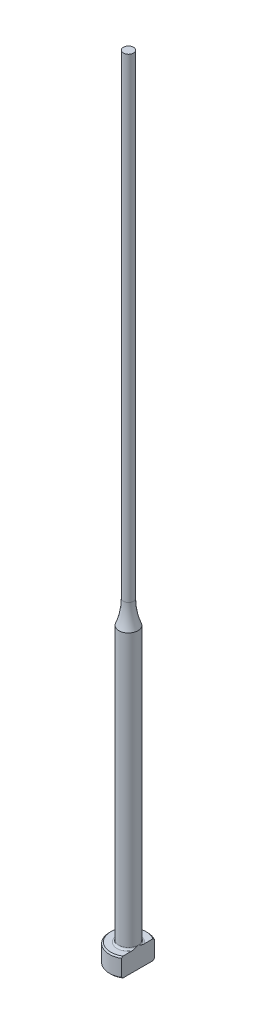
ISO-10303-21;
HEADER;
FILE_DESCRIPTION(('STEP AP214'),'2;1');
FILE_NAME('part.step','',(''),(''),'','','');
FILE_SCHEMA(('AUTOMOTIVE_DESIGN { 1 0 10303 214 1 1 1 1 }'));
ENDSEC;
DATA;
#1=APPLICATION_CONTEXT('core data for automotive mechanical design processes');
#2=APPLICATION_PROTOCOL_DEFINITION('international standard','automotive_design',2000,#1);
#3=PRODUCT_CONTEXT('',#1,'mechanical');
#4=PRODUCT('Part','Part','',(#3));
#5=PRODUCT_RELATED_PRODUCT_CATEGORY('part','',(#4));
#6=PRODUCT_DEFINITION_FORMATION('','',#4);
#7=PRODUCT_DEFINITION_CONTEXT('part definition',#1,'design');
#8=PRODUCT_DEFINITION('design','',#6,#7);
#9=PRODUCT_DEFINITION_SHAPE('','',#8);
#10=(LENGTH_UNIT() NAMED_UNIT(*) SI_UNIT(.MILLI.,.METRE.));
#11=(NAMED_UNIT(*) PLANE_ANGLE_UNIT() SI_UNIT($,.RADIAN.));
#12=(NAMED_UNIT(*) SI_UNIT($,.STERADIAN.) SOLID_ANGLE_UNIT());
#13=UNCERTAINTY_MEASURE_WITH_UNIT(LENGTH_MEASURE(1.E-05),#10,'distance_accuracy_value','');
#14=(GEOMETRIC_REPRESENTATION_CONTEXT(3) GLOBAL_UNCERTAINTY_ASSIGNED_CONTEXT((#13)) GLOBAL_UNIT_ASSIGNED_CONTEXT((#10,
#11,#12)) REPRESENTATION_CONTEXT('',''));
#15=CARTESIAN_POINT('',(0.,0.,0.));
#16=DIRECTION('',(0.,0.,1.));
#17=DIRECTION('',(1.,0.,0.));
#18=AXIS2_PLACEMENT_3D('',#15,#16,#17);
#19=CARTESIAN_POINT('',(-2.99999999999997,3.,0.));
#20=DIRECTION('',(0.,1.,0.));
#21=DIRECTION('',(0.,0.,1.));
#22=AXIS2_PLACEMENT_3D('',#19,#20,#21);
#23=PLANE('',#22);
#24=CARTESIAN_POINT('',(0.,3.,0.));
#25=DIRECTION('',(0.,1.,0.));
#26=DIRECTION('',(0.,0.,1.));
#27=AXIS2_PLACEMENT_3D('',#24,#25,#26);
#28=CIRCLE('',#27,2.79999999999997);
#29=CARTESIAN_POINT('',(1.49999999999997,3.,-2.36431808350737));
#30=VERTEX_POINT('',#29);
#31=CARTESIAN_POINT('',(1.49999999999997,3.,2.36431808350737));
#32=VERTEX_POINT('',#31);
#33=EDGE_CURVE('E187',#30,#32,#28,.T.);
#34=ORIENTED_EDGE('',*,*,#33,.T.);
#35=DIRECTION('',(0.,0.,-1.));
#36=VECTOR('',#35,1.);
#37=CARTESIAN_POINT('',(1.49999999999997,3.,0.));
#38=LINE('',#37,#36);
#39=CARTESIAN_POINT('',(1.49999999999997,3.00000000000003,0.99498743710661));
#40=VERTEX_POINT('',#39);
#41=EDGE_CURVE('E57',#32,#40,#38,.T.);
#42=ORIENTED_EDGE('',*,*,#41,.T.);
#43=CARTESIAN_POINT('',(0.,3.,0.));
#44=DIRECTION('',(0.,1.,0.));
#45=DIRECTION('',(0.,0.,1.));
#46=AXIS2_PLACEMENT_3D('',#43,#44,#45);
#47=CIRCLE('',#46,1.79999999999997);
#48=CARTESIAN_POINT('',(1.49999999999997,3.00000000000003,-0.994987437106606));
#49=VERTEX_POINT('',#48);
#50=EDGE_CURVE('E108',#40,#49,#47,.F.);
#51=ORIENTED_EDGE('',*,*,#50,.T.);
#52=EDGE_CURVE('E137',#49,#30,#38,.T.);
#53=ORIENTED_EDGE('',*,*,#52,.T.);
#54=EDGE_LOOP('',(#34,#42,#51,#53));
#55=FACE_BOUND('',#54,.T.);
#56=ADVANCED_FACE('F32',(#55),#23,.T.);
#57=CARTESIAN_POINT('',(0.,259.958771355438,0.));
#58=DIRECTION('',(0.,1.,0.));
#59=DIRECTION('',(0.,0.,1.));
#60=AXIS2_PLACEMENT_3D('',#57,#58,#59);
#61=CYLINDRICAL_SURFACE('',#60,2.99999999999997);
#62=CARTESIAN_POINT('',(0.,2.80000000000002,0.));
#63=DIRECTION('',(0.,1.,0.));
#64=DIRECTION('',(0.,0.,1.));
#65=AXIS2_PLACEMENT_3D('',#62,#63,#64);
#66=CIRCLE('',#65,2.99999999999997);
#67=CARTESIAN_POINT('',(1.49999999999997,2.80000000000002,2.5980762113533));
#68=VERTEX_POINT('',#67);
#69=CARTESIAN_POINT('',(1.49999999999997,2.80000000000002,-2.5980762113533));
#70=VERTEX_POINT('',#69);
#71=EDGE_CURVE('E105',#68,#70,#66,.F.);
#72=ORIENTED_EDGE('',*,*,#71,.T.);
#73=DIRECTION('',(0.,-1.,0.));
#74=VECTOR('',#73,1.);
#75=CARTESIAN_POINT('',(1.49999999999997,125.,-2.5980762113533));
#76=LINE('',#75,#74);
#77=CARTESIAN_POINT('',(1.49999999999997,0.200000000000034,-2.5980762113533));
#78=VERTEX_POINT('',#77);
#79=EDGE_CURVE('E193',#70,#78,#76,.T.);
#80=ORIENTED_EDGE('',*,*,#79,.T.);
#81=CARTESIAN_POINT('',(0.,0.200000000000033,0.));
#82=DIRECTION('',(0.,-1.,0.));
#83=DIRECTION('',(0.,0.,-1.));
#84=AXIS2_PLACEMENT_3D('',#81,#82,#83);
#85=CIRCLE('',#84,2.99999999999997);
#86=CARTESIAN_POINT('',(1.49999999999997,0.200000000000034,2.5980762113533));
#87=VERTEX_POINT('',#86);
#88=EDGE_CURVE('E100',#78,#87,#85,.F.);
#89=ORIENTED_EDGE('',*,*,#88,.T.);
#90=DIRECTION('',(0.,-1.,0.));
#91=VECTOR('',#90,1.);
#92=CARTESIAN_POINT('',(1.49999999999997,125.,2.5980762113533));
#93=LINE('',#92,#91);
#94=EDGE_CURVE('E93',#68,#87,#93,.T.);
#95=ORIENTED_EDGE('',*,*,#94,.F.);
#96=EDGE_LOOP('',(#72,#80,#89,#95));
#97=FACE_BOUND('',#96,.T.);
#98=ADVANCED_FACE('F158',(#97),#61,.T.);
#99=CARTESIAN_POINT('',(0.,0.,0.));
#100=DIRECTION('',(0.,-1.,0.));
#101=DIRECTION('',(0.,0.,-1.));
#102=AXIS2_PLACEMENT_3D('',#99,#100,#101);
#103=PLANE('',#102);
#104=CARTESIAN_POINT('',(0.,0.,0.));
#105=DIRECTION('',(0.,-1.,0.));
#106=DIRECTION('',(0.,0.,-1.));
#107=AXIS2_PLACEMENT_3D('',#104,#105,#106);
#108=CIRCLE('',#107,2.79999999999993);
#109=CARTESIAN_POINT('',(1.49999999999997,0.,2.36431808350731));
#110=VERTEX_POINT('',#109);
#111=CARTESIAN_POINT('',(1.49999999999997,0.,-2.36431808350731));
#112=VERTEX_POINT('',#111);
#113=EDGE_CURVE('E98',#110,#112,#108,.T.);
#114=ORIENTED_EDGE('',*,*,#113,.T.);
#115=DIRECTION('',(0.,0.,1.));
#116=VECTOR('',#115,1.);
#117=CARTESIAN_POINT('',(1.49999999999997,0.,-2.5980762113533));
#118=LINE('',#117,#116);
#119=EDGE_CURVE('E83',#112,#110,#118,.T.);
#120=ORIENTED_EDGE('',*,*,#119,.T.);
#121=EDGE_LOOP('',(#114,#120));
#122=FACE_BOUND('',#121,.T.);
#123=ADVANCED_FACE('F103',(#122),#103,.T.);
#124=CARTESIAN_POINT('',(0.,3.,0.));
#125=DIRECTION('',(0.,-1.,0.));
#126=DIRECTION('',(0.,0.,-1.));
#127=AXIS2_PLACEMENT_3D('',#124,#125,#126);
#128=CONICAL_SURFACE('',#127,2.79999999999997,0.7853981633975);
#129=ORIENTED_EDGE('',*,*,#71,.F.);
#130=CARTESIAN_POINT('',(1.49999999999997,-0.11174109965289,5.71827621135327));
#131=CARTESIAN_POINT('',(1.49999999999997,0.0136183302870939,5.58866816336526));
#132=CARTESIAN_POINT('',(1.49999999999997,0.138843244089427,5.45892957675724));
#133=CARTESIAN_POINT('',(1.49999999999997,0.388944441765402,5.19911365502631));
#134=CARTESIAN_POINT('',(1.49999999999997,0.513820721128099,5.06903631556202));
#135=CARTESIAN_POINT('',(1.49999999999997,0.763205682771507,4.8084018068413));
#136=CARTESIAN_POINT('',(1.49999999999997,0.887714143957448,4.67784442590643));
#137=CARTESIAN_POINT('',(1.49999999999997,1.13618059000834,4.41620813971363));
#138=CARTESIAN_POINT('',(1.49999999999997,1.2601385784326,4.28512923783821));
#139=CARTESIAN_POINT('',(1.49999999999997,1.50488975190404,4.02490837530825));
#140=CARTESIAN_POINT('',(1.49999999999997,1.6256969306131,3.89577958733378));
#141=CARTESIAN_POINT('',(1.49999999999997,1.86640694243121,3.63668213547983));
#142=CARTESIAN_POINT('',(1.49999999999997,1.98630978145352,3.5067134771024));
#143=CARTESIAN_POINT('',(1.49999999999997,2.22486033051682,3.24567921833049));
#144=CARTESIAN_POINT('',(1.49999999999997,2.34350830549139,3.11461386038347));
#145=CARTESIAN_POINT('',(1.49999999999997,2.57907716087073,2.85094268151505));
#146=CARTESIAN_POINT('',(1.49999999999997,2.69599811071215,2.71833692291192));
#147=CARTESIAN_POINT('',(1.49999999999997,2.88262371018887,2.50255231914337));
#148=CARTESIAN_POINT('',(1.49999999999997,2.95312454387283,2.42006293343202));
#149=CARTESIAN_POINT('',(1.49999999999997,3.09287098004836,2.25401084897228));
#150=CARTESIAN_POINT('',(1.49999999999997,3.16211645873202,2.170448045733));
#151=CARTESIAN_POINT('',(1.49999999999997,3.2996468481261,2.00105967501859));
#152=CARTESIAN_POINT('',(1.49999999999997,3.36791386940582,1.91521952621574));
#153=CARTESIAN_POINT('',(1.49999999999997,3.50205840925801,1.74171392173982));
#154=CARTESIAN_POINT('',(1.49999999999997,3.56793649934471,1.65404891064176));
#155=CARTESIAN_POINT('',(1.49999999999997,3.69728151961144,1.47490236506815));
#156=CARTESIAN_POINT('',(1.49999999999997,3.76069661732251,1.38338308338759));
#157=CARTESIAN_POINT('',(1.49999999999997,3.88239539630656,1.1967566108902));
#158=CARTESIAN_POINT('',(1.49999999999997,3.94067201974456,1.10164473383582));
#159=CARTESIAN_POINT('',(1.49999999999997,4.0484132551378,0.908008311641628));
#160=CARTESIAN_POINT('',(1.49999999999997,4.09797809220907,0.809540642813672));
#161=CARTESIAN_POINT('',(1.49999999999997,4.18432188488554,0.607192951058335));
#162=CARTESIAN_POINT('',(1.49999999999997,4.22114374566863,0.503332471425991));
#163=CARTESIAN_POINT('',(1.49999999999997,4.26099935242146,0.347577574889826));
#164=CARTESIAN_POINT('',(1.49999999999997,4.27157029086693,0.29760995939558));
#165=CARTESIAN_POINT('',(1.49999999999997,4.28794860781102,0.196885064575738));
#166=CARTESIAN_POINT('',(1.49999999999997,4.29375640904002,0.146127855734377));
#167=CARTESIAN_POINT('',(1.49999999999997,4.30019707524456,0.0444388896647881));
#168=CARTESIAN_POINT('',(1.49999999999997,4.30084594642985,-0.00649183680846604));
#169=CARTESIAN_POINT('',(1.49999999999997,4.29696416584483,-0.108155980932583));
#170=CARTESIAN_POINT('',(1.49999999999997,4.29243308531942,-0.158889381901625));
#171=CARTESIAN_POINT('',(1.49999999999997,4.27856915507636,-0.259234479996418));
#172=CARTESIAN_POINT('',(1.49999999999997,4.26927821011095,-0.308852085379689));
#173=CARTESIAN_POINT('',(1.49999999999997,4.24647108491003,-0.407110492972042));
#174=CARTESIAN_POINT('',(1.49999999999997,4.2329532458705,-0.455750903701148));
#175=CARTESIAN_POINT('',(1.49999999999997,4.20226175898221,-0.552149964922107));
#176=CARTESIAN_POINT('',(1.49999999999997,4.18506801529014,-0.599902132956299));
#177=CARTESIAN_POINT('',(1.49999999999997,4.14771387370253,-0.694205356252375));
#178=CARTESIAN_POINT('',(1.49999999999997,4.12755408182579,-0.740756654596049));
#179=CARTESIAN_POINT('',(1.49999999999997,4.06327696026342,-0.879166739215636));
#180=CARTESIAN_POINT('',(1.49999999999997,4.01551721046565,-0.969329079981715));
#181=CARTESIAN_POINT('',(1.49999999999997,3.91367909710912,-1.1460431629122));
#182=CARTESIAN_POINT('',(1.49999999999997,3.85959300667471,-1.23259031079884));
#183=CARTESIAN_POINT('',(1.49999999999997,3.74697968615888,-1.40321348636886));
#184=CARTESIAN_POINT('',(1.49999999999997,3.68843573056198,-1.48727838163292));
#185=CARTESIAN_POINT('',(1.49999999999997,3.56843845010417,-1.65322187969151));
#186=CARTESIAN_POINT('',(1.49999999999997,3.50698656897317,-1.73510153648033));
#187=CARTESIAN_POINT('',(1.49999999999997,3.38115673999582,-1.89829823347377));
#188=CARTESIAN_POINT('',(1.49999999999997,3.31675092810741,-1.9795936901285));
#189=CARTESIAN_POINT('',(1.49999999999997,3.18634068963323,-2.14090082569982));
#190=CARTESIAN_POINT('',(1.49999999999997,3.12033609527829,-2.22091236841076));
#191=CARTESIAN_POINT('',(1.49999999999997,2.9208643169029,-2.4590650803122));
#192=CARTESIAN_POINT('',(1.49999999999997,2.78562663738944,-2.6157209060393));
#193=CARTESIAN_POINT('',(1.49999999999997,2.53554498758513,-2.90006295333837));
#194=CARTESIAN_POINT('',(1.49999999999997,2.421145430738,-3.02814382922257));
#195=CARTESIAN_POINT('',(1.49999999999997,2.19093557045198,-3.28303767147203));
#196=CARTESIAN_POINT('',(1.49999999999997,2.07512522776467,-3.40985060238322));
#197=CARTESIAN_POINT('',(1.49999999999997,1.72597067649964,-3.78913849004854));
#198=CARTESIAN_POINT('',(1.49999999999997,1.49111760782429,-4.04022177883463));
#199=CARTESIAN_POINT('',(1.49999999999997,1.02882478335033,-4.52992803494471));
#200=CARTESIAN_POINT('',(1.49999999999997,0.801477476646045,-4.76863870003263));
#201=CARTESIAN_POINT('',(1.49999999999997,0.459548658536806,-5.12558036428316));
#202=CARTESIAN_POINT('',(1.49999999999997,0.345484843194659,-5.24430773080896));
#203=CARTESIAN_POINT('',(1.49999999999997,0.117071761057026,-5.48148573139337));
#204=CARTESIAN_POINT('',(1.49999999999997,0.00272249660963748,-5.59993636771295));
#205=CARTESIAN_POINT('',(1.49999999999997,-0.111741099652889,-5.71827621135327));
#206=B_SPLINE_CURVE_WITH_KNOTS('',3,(#130,#131,#132,#133,#134,#135,#136,#137,#138,#139,#140,
#141,#142,#143,#144,#145,#146,#147,#148,#149,#150,#151,#152,#153,#154,#155,#156,#157,#158,#159,
#160,#161,#162,#163,#164,#165,#166,#167,#168,#169,#170,#171,#172,#173,#174,#175,#176,#177,#178,
#179,#180,#181,#182,#183,#184,#185,#186,#187,#188,#189,#190,#191,#192,#193,#194,#195,#196,#197,
#198,#199,#200,#201,#202,#203,#204,#205),.UNSPECIFIED.,.F.,.F.,(4,2,2,2,2,2,2,2,2,2,2,2,2,2,2,2,
2,2,2,2,2,2,2,2,2,2,2,2,2,2,2,2,2,2,2,2,2,4),(0.,0.540943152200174,1.08189327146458,
1.62312052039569,2.16434426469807,2.69482920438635,3.22531067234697,3.75567781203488,
4.28602356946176,4.61155053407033,4.93710943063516,5.26610945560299,5.59503024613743,
5.92894782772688,6.26331713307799,6.59354403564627,6.92264800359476,7.07567478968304,
7.22868799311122,7.38122626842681,7.53377717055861,7.68500755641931,7.83629736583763,
7.98843643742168,8.14054446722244,8.4461879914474,8.75220879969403,9.05944044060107,
9.366521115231,9.677642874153,9.98879742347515,10.6095925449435,11.1247803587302,
11.6399825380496,12.6713544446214,13.6603005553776,14.1542238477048,14.648143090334),.UNSPECIFIED.);
#207=EDGE_CURVE('E136',#68,#32,#206,.T.);
#208=ORIENTED_EDGE('',*,*,#207,.T.);
#209=ORIENTED_EDGE('',*,*,#33,.F.);
#210=EDGE_CURVE('E128',#30,#70,#206,.T.);
#211=ORIENTED_EDGE('',*,*,#210,.T.);
#212=EDGE_LOOP('',(#129,#208,#209,#211));
#213=FACE_BOUND('',#212,.T.);
#214=ADVANCED_FACE('F144',(#213),#128,.T.);
#215=CARTESIAN_POINT('',(0.,0.200000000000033,0.));
#216=DIRECTION('',(0.,1.,0.));
#217=DIRECTION('',(0.,0.,1.));
#218=AXIS2_PLACEMENT_3D('',#215,#216,#217);
#219=CONICAL_SURFACE('',#218,2.99999999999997,0.785398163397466);
#220=ORIENTED_EDGE('',*,*,#88,.F.);
#221=CARTESIAN_POINT('',(1.49999999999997,3.11174109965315,-5.71827621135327));
#222=CARTESIAN_POINT('',(1.49999999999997,2.98638166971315,-5.58866816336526));
#223=CARTESIAN_POINT('',(1.49999999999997,2.8611567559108,-5.45892957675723));
#224=CARTESIAN_POINT('',(1.49999999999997,2.6110555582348,-5.19911365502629));
#225=CARTESIAN_POINT('',(1.49999999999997,2.48617927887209,-5.06903631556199));
#226=CARTESIAN_POINT('',(1.49999999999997,2.23679431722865,-4.80840180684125));
#227=CARTESIAN_POINT('',(1.49999999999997,2.11228585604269,-4.67784442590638));
#228=CARTESIAN_POINT('',(1.49999999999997,1.86381940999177,-4.41620813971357));
#229=CARTESIAN_POINT('',(1.49999999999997,1.7398614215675,-4.28512923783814));
#230=CARTESIAN_POINT('',(1.49999999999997,1.49511024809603,-4.02490837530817));
#231=CARTESIAN_POINT('',(1.49999999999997,1.37430306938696,-3.89577958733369));
#232=CARTESIAN_POINT('',(1.49999999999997,1.13359305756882,-3.63668213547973));
#233=CARTESIAN_POINT('',(1.49999999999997,1.0136902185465,-3.50671347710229));
#234=CARTESIAN_POINT('',(1.49999999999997,0.775139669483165,-3.24567921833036));
#235=CARTESIAN_POINT('',(1.49999999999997,0.656491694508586,-3.11461386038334));
#236=CARTESIAN_POINT('',(1.49999999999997,0.420922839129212,-2.85094268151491));
#237=CARTESIAN_POINT('',(1.49999999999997,0.304001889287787,-2.71833692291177));
#238=CARTESIAN_POINT('',(1.49999999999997,0.117376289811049,-2.50255231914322));
#239=CARTESIAN_POINT('',(1.49999999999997,0.0468754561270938,-2.42006293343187));
#240=CARTESIAN_POINT('',(1.49999999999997,-0.0928709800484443,-2.25401084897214));
#241=CARTESIAN_POINT('',(1.49999999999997,-0.162116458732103,-2.17044804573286));
#242=CARTESIAN_POINT('',(1.49999999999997,-0.299646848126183,-2.00105967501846));
#243=CARTESIAN_POINT('',(1.49999999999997,-0.367913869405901,-1.91521952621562));
#244=CARTESIAN_POINT('',(1.49999999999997,-0.502058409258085,-1.74171392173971));
#245=CARTESIAN_POINT('',(1.49999999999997,-0.567936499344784,-1.65404891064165));
#246=CARTESIAN_POINT('',(1.49999999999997,-0.697281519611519,-1.47490236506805));
#247=CARTESIAN_POINT('',(1.49999999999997,-0.760696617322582,-1.38338308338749));
#248=CARTESIAN_POINT('',(1.49999999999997,-0.882395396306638,-1.19675661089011));
#249=CARTESIAN_POINT('',(1.49999999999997,-0.940672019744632,-1.10164473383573));
#250=CARTESIAN_POINT('',(1.49999999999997,-1.04841325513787,-0.908008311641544));
#251=CARTESIAN_POINT('',(1.49999999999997,-1.09797809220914,-0.809540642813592));
#252=CARTESIAN_POINT('',(1.49999999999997,-1.1843218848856,-0.60719295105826));
#253=CARTESIAN_POINT('',(1.49999999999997,-1.22114374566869,-0.503332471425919));
#254=CARTESIAN_POINT('',(1.49999999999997,-1.26099935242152,-0.347577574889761));
#255=CARTESIAN_POINT('',(1.49999999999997,-1.27157029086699,-0.29760995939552));
#256=CARTESIAN_POINT('',(1.49999999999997,-1.28794860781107,-0.196885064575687));
#257=CARTESIAN_POINT('',(1.49999999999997,-1.29375640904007,-0.146127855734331));
#258=CARTESIAN_POINT('',(1.49999999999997,-1.30019707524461,-0.0444388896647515));
#259=CARTESIAN_POINT('',(1.49999999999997,-1.3008459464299,0.00649183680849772));
#260=CARTESIAN_POINT('',(1.49999999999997,-1.29696416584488,0.108155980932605));
#261=CARTESIAN_POINT('',(1.49999999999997,-1.29243308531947,0.158889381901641));
#262=CARTESIAN_POINT('',(1.49999999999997,-1.2785691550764,0.259234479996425));
#263=CARTESIAN_POINT('',(1.49999999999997,-1.26927821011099,0.308852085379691));
#264=CARTESIAN_POINT('',(1.49999999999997,-1.24647108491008,0.407110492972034));
#265=CARTESIAN_POINT('',(1.49999999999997,-1.23295324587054,0.455750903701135));
#266=CARTESIAN_POINT('',(1.49999999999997,-1.20226175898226,0.552149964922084));
#267=CARTESIAN_POINT('',(1.49999999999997,-1.18506801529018,0.599902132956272));
#268=CARTESIAN_POINT('',(1.49999999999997,-1.14771387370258,0.694205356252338));
#269=CARTESIAN_POINT('',(1.49999999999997,-1.12755408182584,0.740756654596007));
#270=CARTESIAN_POINT('',(1.49999999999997,-1.06327696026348,0.879166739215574));
#271=CARTESIAN_POINT('',(1.49999999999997,-1.01551721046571,0.969329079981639));
#272=CARTESIAN_POINT('',(1.49999999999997,-0.913679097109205,1.1460431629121));
#273=CARTESIAN_POINT('',(1.49999999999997,-0.8595930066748,1.23259031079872));
#274=CARTESIAN_POINT('',(1.49999999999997,-0.746979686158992,1.40321348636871));
#275=CARTESIAN_POINT('',(1.49999999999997,-0.688435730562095,1.48727838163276));
#276=CARTESIAN_POINT('',(1.49999999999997,-0.568438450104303,1.65322187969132));
#277=CARTESIAN_POINT('',(1.49999999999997,-0.506986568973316,1.73510153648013));
#278=CARTESIAN_POINT('',(1.49999999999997,-0.381156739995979,1.89829823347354));
#279=CARTESIAN_POINT('',(1.49999999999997,-0.316750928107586,1.97959369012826));
#280=CARTESIAN_POINT('',(1.49999999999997,-0.186340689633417,2.14090082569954));
#281=CARTESIAN_POINT('',(1.49999999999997,-0.120336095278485,2.22091236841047));
#282=CARTESIAN_POINT('',(1.49999999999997,0.0791356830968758,2.45906508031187));
#283=CARTESIAN_POINT('',(1.49999999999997,0.214373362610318,2.61572090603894));
#284=CARTESIAN_POINT('',(1.49999999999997,0.46445501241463,2.90006295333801));
#285=CARTESIAN_POINT('',(1.49999999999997,0.578854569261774,3.02814382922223));
#286=CARTESIAN_POINT('',(1.49999999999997,0.809064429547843,3.28303767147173));
#287=CARTESIAN_POINT('',(1.49999999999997,0.924874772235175,3.40985060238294));
#288=CARTESIAN_POINT('',(1.49999999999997,1.27402932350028,3.78913849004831));
#289=CARTESIAN_POINT('',(1.49999999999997,1.50888239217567,4.04022177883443));
#290=CARTESIAN_POINT('',(1.49999999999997,1.97117521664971,4.52992803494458));
#291=CARTESIAN_POINT('',(1.49999999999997,2.19852252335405,4.76863870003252));
#292=CARTESIAN_POINT('',(1.49999999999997,2.54045134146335,5.12558036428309));
#293=CARTESIAN_POINT('',(1.49999999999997,2.65451515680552,5.2443077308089));
#294=CARTESIAN_POINT('',(1.49999999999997,2.88292823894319,5.48148573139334));
#295=CARTESIAN_POINT('',(1.49999999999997,2.9972775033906,5.59993636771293));
#296=CARTESIAN_POINT('',(1.49999999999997,3.11174109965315,5.71827621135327));
#297=B_SPLINE_CURVE_WITH_KNOTS('',3,(#221,#222,#223,#224,#225,#226,#227,#228,#229,#230,#231,
#232,#233,#234,#235,#236,#237,#238,#239,#240,#241,#242,#243,#244,#245,#246,#247,#248,#249,#250,
#251,#252,#253,#254,#255,#256,#257,#258,#259,#260,#261,#262,#263,#264,#265,#266,#267,#268,#269,
#270,#271,#272,#273,#274,#275,#276,#277,#278,#279,#280,#281,#282,#283,#284,#285,#286,#287,#288,
#289,#290,#291,#292,#293,#294,#295,#296),.UNSPECIFIED.,.F.,.F.,(4,2,2,2,2,2,2,2,2,2,2,2,2,2,2,2,
2,2,2,2,2,2,2,2,2,2,2,2,2,2,2,2,2,2,2,2,2,4),(0.,0.540943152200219,1.08189327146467,
1.62312052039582,2.16434426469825,2.69482920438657,3.22531067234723,3.75567781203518,
4.28602356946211,4.61155053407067,4.93710943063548,5.2661094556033,5.59503024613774,
5.92894782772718,6.26331713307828,6.59354403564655,6.92264800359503,7.0756747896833,
7.22868799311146,7.38122626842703,7.53377717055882,7.68500755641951,7.83629736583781,
7.98843643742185,8.14054446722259,8.4461879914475,8.75220879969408,9.05944044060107,
9.36652111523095,9.6776428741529,9.98879742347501,10.6095925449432,11.1247803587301,
11.6399825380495,12.6713544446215,13.6603005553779,14.1542238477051,14.6481430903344),.UNSPECIFIED.);
#298=EDGE_CURVE('E86',#78,#112,#297,.T.);
#299=ORIENTED_EDGE('',*,*,#298,.T.);
#300=ORIENTED_EDGE('',*,*,#113,.F.);
#301=EDGE_CURVE('E89',#110,#87,#297,.T.);
#302=ORIENTED_EDGE('',*,*,#301,.T.);
#303=EDGE_LOOP('',(#220,#299,#300,#302));
#304=FACE_BOUND('',#303,.T.);
#305=ADVANCED_FACE('F97',(#304),#219,.T.);
#306=CARTESIAN_POINT('',(0.,3.30000000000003,0.));
#307=DIRECTION('',(0.,1.,0.));
#308=DIRECTION('',(0.,0.,1.));
#309=AXIS2_PLACEMENT_3D('',#306,#307,#308);
#310=TOROIDAL_SURFACE('',#309,1.79999999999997,0.3);
#311=CARTESIAN_POINT('',(1.49999999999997,3.30000000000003,0.));
#312=CARTESIAN_POINT('',(1.49999999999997,3.300000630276,3.41555678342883E-12));
#313=CARTESIAN_POINT('',(1.49999999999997,3.30000126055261,-1.15373640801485E-07));
#314=CARTESIAN_POINT('',(1.49999999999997,3.3000024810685,-4.90631575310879E-07));
#315=CARTESIAN_POINT('',(1.49999999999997,3.30000307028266,-7.53296670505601E-07));
#316=CARTESIAN_POINT('',(1.49999999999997,3.30000424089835,-1.38757096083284E-06));
#317=CARTESIAN_POINT('',(1.49999999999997,3.300004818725,-1.76563001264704E-06));
#318=CARTESIAN_POINT('',(1.49999999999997,3.30000591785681,-2.58768006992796E-06));
#319=CARTESIAN_POINT('',(1.49999999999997,3.30000643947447,-3.03127014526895E-06));
#320=CARTESIAN_POINT('',(1.49999999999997,3.30000815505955,-4.60021967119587E-06));
#321=CARTESIAN_POINT('',(1.49999999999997,3.30000927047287,-5.8124152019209E-06));
#322=CARTESIAN_POINT('',(1.49999999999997,3.30001128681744,-8.33989413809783E-06));
#323=CARTESIAN_POINT('',(1.49999999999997,3.30001219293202,-9.65128157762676E-06));
#324=CARTESIAN_POINT('',(1.49999999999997,3.30001551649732,-1.46782505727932E-05));
#325=CARTESIAN_POINT('',(1.49999999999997,3.30001775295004,-1.8517976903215E-05));
#326=CARTESIAN_POINT('',(1.49999999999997,3.30002148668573,-2.61616194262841E-05));
#327=CARTESIAN_POINT('',(1.49999999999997,3.30002302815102,-2.99447742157E-05));
#328=CARTESIAN_POINT('',(1.49999999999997,3.30002943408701,-4.58003743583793E-05));
#329=CARTESIAN_POINT('',(1.49999999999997,3.3000341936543,-5.79079078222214E-05));
#330=CARTESIAN_POINT('',(1.49999999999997,3.30004197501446,-8.07263755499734E-05));
#331=CARTESIAN_POINT('',(1.49999999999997,3.30004514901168,-9.13834709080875E-05));
#332=CARTESIAN_POINT('',(1.49999999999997,3.30006989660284,-0.000167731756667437));
#333=CARTESIAN_POINT('',(1.49999999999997,3.30010092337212,-0.000229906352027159));
#334=CARTESIAN_POINT('',(1.49999999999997,3.30021632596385,-0.000470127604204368));
#335=CARTESIAN_POINT('',(1.49999999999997,3.30029368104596,-0.000650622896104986));
#336=CARTESIAN_POINT('',(1.49999999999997,3.30059619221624,-0.00134589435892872));
#337=CARTESIAN_POINT('',(1.49999999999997,3.30082870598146,-0.00185814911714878));
#338=CARTESIAN_POINT('',(1.49999999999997,3.30176696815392,-0.00393547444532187));
#339=CARTESIAN_POINT('',(1.49999999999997,3.30246445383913,-0.00550332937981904));
#340=CARTESIAN_POINT('',(1.49999999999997,3.31426785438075,-0.0320229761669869));
#341=CARTESIAN_POINT('',(1.49999999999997,3.32544800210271,-0.0569503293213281));
#342=CARTESIAN_POINT('',(1.49999999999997,3.34725700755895,-0.105984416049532));
#343=CARTESIAN_POINT('',(1.49999999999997,3.35789134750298,-0.130088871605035));
#344=CARTESIAN_POINT('',(1.49999999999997,3.38015321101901,-0.181096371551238));
#345=CARTESIAN_POINT('',(1.49999999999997,3.39175804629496,-0.208009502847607));
#346=CARTESIAN_POINT('',(1.49999999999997,3.41469034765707,-0.262264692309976));
#347=CARTESIAN_POINT('',(1.49999999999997,3.42601398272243,-0.289608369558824));
#348=CARTESIAN_POINT('',(1.49999999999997,3.45363212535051,-0.35820378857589));
#349=CARTESIAN_POINT('',(1.49999999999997,3.46959026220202,-0.39959288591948));
#350=CARTESIAN_POINT('',(1.49999999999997,3.49940505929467,-0.482097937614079));
#351=CARTESIAN_POINT('',(1.49999999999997,3.51330033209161,-0.523199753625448));
#352=CARTESIAN_POINT('',(1.49999999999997,3.53552507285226,-0.595497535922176));
#353=CARTESIAN_POINT('',(1.49999999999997,3.54436834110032,-0.626532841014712));
#354=CARTESIAN_POINT('',(1.49999999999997,3.56052427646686,-0.6891760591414));
#355=CARTESIAN_POINT('',(1.49999999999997,3.5678279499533,-0.720786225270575));
#356=CARTESIAN_POINT('',(1.49999999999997,3.5875075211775,-0.819524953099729));
#357=CARTESIAN_POINT('',(1.49999999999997,3.59661044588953,-0.88742909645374));
#358=CARTESIAN_POINT('',(1.49999999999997,3.60059842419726,-0.991180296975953));
#359=CARTESIAN_POINT('',(1.49999999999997,3.60019840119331,-1.02684364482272));
#360=CARTESIAN_POINT('',(1.49999999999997,3.59497085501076,-1.097505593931));
#361=CARTESIAN_POINT('',(1.49999999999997,3.59019295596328,-1.13250716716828));
#362=CARTESIAN_POINT('',(1.49999999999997,3.57687734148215,-1.19353096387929));
#363=CARTESIAN_POINT('',(1.49999999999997,3.56943875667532,-1.21978854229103));
#364=CARTESIAN_POINT('',(1.49999999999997,3.55063748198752,-1.27094658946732));
#365=CARTESIAN_POINT('',(1.49999999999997,3.53927342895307,-1.29584658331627));
#366=CARTESIAN_POINT('',(1.49999999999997,3.51660016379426,-1.33501873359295));
#367=CARTESIAN_POINT('',(1.49999999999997,3.50657738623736,-1.35003296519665));
#368=CARTESIAN_POINT('',(1.49999999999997,3.48437469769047,-1.37837252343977));
#369=CARTESIAN_POINT('',(1.49999999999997,3.47219867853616,-1.39170082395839));
#370=CARTESIAN_POINT('',(1.49999999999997,3.44835614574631,-1.41349417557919));
#371=CARTESIAN_POINT('',(1.49999999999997,3.43709185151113,-1.42239673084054));
#372=CARTESIAN_POINT('',(1.49999999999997,3.41325256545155,-1.43825467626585));
#373=CARTESIAN_POINT('',(1.49999999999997,3.40067804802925,-1.44521076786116));
#374=CARTESIAN_POINT('',(1.49999999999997,3.37433767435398,-1.45677158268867));
#375=CARTESIAN_POINT('',(1.49999999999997,3.36056203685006,-1.46135438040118));
#376=CARTESIAN_POINT('',(1.49999999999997,3.33237324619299,-1.46767730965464));
#377=CARTESIAN_POINT('',(1.49999999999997,3.31796076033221,-1.46942034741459));
#378=CARTESIAN_POINT('',(1.49999999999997,3.29122479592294,-1.4698720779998));
#379=CARTESIAN_POINT('',(1.49999999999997,3.27890664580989,-1.468990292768));
#380=CARTESIAN_POINT('',(1.49999999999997,3.25461019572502,-1.4651157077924));
#381=CARTESIAN_POINT('',(1.49999999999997,3.2426318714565,-1.46212305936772));
#382=CARTESIAN_POINT('',(1.49999999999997,3.21959683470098,-1.4543117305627));
#383=CARTESIAN_POINT('',(1.49999999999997,3.20852542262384,-1.44953579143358));
#384=CARTESIAN_POINT('',(1.49999999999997,3.18721125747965,-1.43840957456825));
#385=CARTESIAN_POINT('',(1.49999999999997,3.1769687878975,-1.43205876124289));
#386=CARTESIAN_POINT('',(1.49999999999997,3.15325976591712,-1.41506353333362));
#387=CARTESIAN_POINT('',(1.49999999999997,3.14027750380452,-1.40374235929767));
#388=CARTESIAN_POINT('',(1.49999999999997,3.11630720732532,-1.37914825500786));
#389=CARTESIAN_POINT('',(1.49999999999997,3.10532420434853,-1.36587054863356));
#390=CARTESIAN_POINT('',(1.49999999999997,3.08100891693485,-1.33197272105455));
#391=CARTESIAN_POINT('',(1.49999999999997,3.06867625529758,-1.31063843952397));
#392=CARTESIAN_POINT('',(1.49999999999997,3.04751867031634,-1.26637455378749));
#393=CARTESIAN_POINT('',(1.49999999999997,3.03869240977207,-1.24344556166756));
#394=CARTESIAN_POINT('',(1.49999999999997,3.01978360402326,-1.18316534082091));
#395=CARTESIAN_POINT('',(1.49999999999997,3.01191472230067,-1.14512623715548));
#396=CARTESIAN_POINT('',(1.49999999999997,3.00188285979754,-1.06789971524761));
#397=CARTESIAN_POINT('',(1.49999999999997,2.99979735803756,-1.02870374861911));
#398=CARTESIAN_POINT('',(1.49999999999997,3.00021727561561,-0.953160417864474));
#399=CARTESIAN_POINT('',(1.49999999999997,3.00240673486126,-0.916808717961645));
#400=CARTESIAN_POINT('',(1.49999999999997,3.0099643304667,-0.844432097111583));
#401=CARTESIAN_POINT('',(1.49999999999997,3.01533462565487,-0.808407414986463));
#402=CARTESIAN_POINT('',(1.49999999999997,3.02828086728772,-0.738670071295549));
#403=CARTESIAN_POINT('',(1.49999999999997,3.03573028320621,-0.704933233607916));
#404=CARTESIAN_POINT('',(1.49999999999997,3.05243174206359,-0.638128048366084));
#405=CARTESIAN_POINT('',(1.49999999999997,3.06167285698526,-0.605056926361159));
#406=CARTESIAN_POINT('',(1.49999999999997,3.08440652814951,-0.53019513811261));
#407=CARTESIAN_POINT('',(1.49999999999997,3.09836576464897,-0.488547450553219));
#408=CARTESIAN_POINT('',(1.49999999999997,3.1283820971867,-0.404954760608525));
#409=CARTESIAN_POINT('',(1.49999999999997,3.14447968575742,-0.363024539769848));
#410=CARTESIAN_POINT('',(1.49999999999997,3.17238454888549,-0.293508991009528));
#411=CARTESIAN_POINT('',(1.49999999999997,3.18384249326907,-0.265781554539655));
#412=CARTESIAN_POINT('',(1.49999999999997,3.20705854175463,-0.210769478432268));
#413=CARTESIAN_POINT('',(1.49999999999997,3.21881265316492,-0.183483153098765));
#414=CARTESIAN_POINT('',(1.49999999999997,3.24136702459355,-0.131772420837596));
#415=CARTESIAN_POINT('',(1.49999999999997,3.25214361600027,-0.107337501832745));
#416=CARTESIAN_POINT('',(1.49999999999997,3.27424746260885,-0.0576321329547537));
#417=CARTESIAN_POINT('',(1.49999999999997,3.28558038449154,-0.0323640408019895));
#418=CARTESIAN_POINT('',(1.49999999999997,3.29753556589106,-0.00550327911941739));
#419=CARTESIAN_POINT('',(1.49999999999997,3.29823307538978,-0.00393537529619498));
#420=CARTESIAN_POINT('',(1.49999999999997,3.29917134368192,-0.00185803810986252));
#421=CARTESIAN_POINT('',(1.49999999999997,3.29940384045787,-0.00134582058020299));
#422=CARTESIAN_POINT('',(1.49999999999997,3.29970633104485,-0.000650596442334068));
#423=CARTESIAN_POINT('',(1.49999999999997,3.29978368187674,-0.000470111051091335));
#424=CARTESIAN_POINT('',(1.49999999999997,3.29989907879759,-0.000229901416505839));
#425=CARTESIAN_POINT('',(1.49999999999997,3.29993010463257,-0.000167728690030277));
#426=CARTESIAN_POINT('',(1.49999999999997,3.29995485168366,-9.13825689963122E-05));
#427=CARTESIAN_POINT('',(1.49999999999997,3.29995802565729,-8.07256241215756E-05));
#428=CARTESIAN_POINT('',(1.49999999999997,3.29996580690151,-5.79074820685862E-05));
#429=CARTESIAN_POINT('',(1.49999999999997,3.29997056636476,-4.5800119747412E-05));
#430=CARTESIAN_POINT('',(1.49999999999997,3.29997697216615,-2.99447119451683E-05));
#431=CARTESIAN_POINT('',(1.49999999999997,3.2999785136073,-2.61615817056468E-05));
#432=CARTESIAN_POINT('',(1.49999999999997,3.2999822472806,-1.85179845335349E-05));
#433=CARTESIAN_POINT('',(1.49999999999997,3.29998448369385,-1.46782782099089E-05));
#434=CARTESIAN_POINT('',(1.49999999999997,3.2999878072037,-9.65132752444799E-06));
#435=CARTESIAN_POINT('',(1.49999999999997,3.299988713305,-8.33994202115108E-06));
#436=CARTESIAN_POINT('',(1.49999999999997,3.29999072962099,-5.81246426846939E-06));
#437=CARTESIAN_POINT('',(1.49999999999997,3.29999184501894,-4.600267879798E-06));
#438=CARTESIAN_POINT('',(1.49999999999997,3.29999356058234,-3.03131394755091E-06));
#439=CARTESIAN_POINT('',(1.49999999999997,3.29999408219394,-2.58772196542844E-06));
#440=CARTESIAN_POINT('',(1.49999999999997,3.2999951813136,-1.76566701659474E-06));
#441=CARTESIAN_POINT('',(1.49999999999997,3.29999575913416,-1.38760497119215E-06));
#442=CARTESIAN_POINT('',(1.49999999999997,3.29999692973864,-7.53323425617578E-07));
#443=CARTESIAN_POINT('',(1.49999999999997,3.29999751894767,-4.90654189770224E-07));
#444=CARTESIAN_POINT('',(1.49999999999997,3.29999873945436,-1.15386267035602E-07));
#445=CARTESIAN_POINT('',(1.49999999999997,3.29999936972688,-3.41554144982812E-12));
#446=CARTESIAN_POINT('',(1.49999999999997,3.30000000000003,0.));
#447=B_SPLINE_CURVE_WITH_KNOTS('',3,(#311,#312,#313,#314,#315,#316,#317,#318,#319,#320,#321,
#322,#323,#324,#325,#326,#327,#328,#329,#330,#331,#332,#333,#334,#335,#336,#337,#338,#339,#340,
#341,#342,#343,#344,#345,#346,#347,#348,#349,#350,#351,#352,#353,#354,#355,#356,#357,#358,#359,
#360,#361,#362,#363,#364,#365,#366,#367,#368,#369,#370,#371,#372,#373,#374,#375,#376,#377,#378,
#379,#380,#381,#382,#383,#384,#385,#386,#387,#388,#389,#390,#391,#392,#393,#394,#395,#396,#397,
#398,#399,#400,#401,#402,#403,#404,#405,#406,#407,#408,#409,#410,#411,#412,#413,#414,#415,#416,
#417,#418,#419,#420,#421,#422,#423,#424,#425,#426,#427,#428,#429,#430,#431,#432,#433,#434,#435,
#436,#437,#438,#439,#440,#441,#442,#443,#444,#445,#446),.UNSPECIFIED.,.T.,.F.,(4,2,2,2,2,2,2,2,
2,2,2,2,2,2,2,2,2,2,2,2,2,2,2,2,2,2,2,2,2,2,2,2,2,2,2,2,2,2,2,2,2,2,2,2,2,2,2,2,2,2,2,2,2,2,2,2,
2,2,2,2,2,2,2,2,2,2,2,4),(0.,1.88906036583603E-06,3.8150959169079E-06,5.87892837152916E-06,
7.93062024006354E-06,1.28480890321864E-05,1.76261717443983E-05,3.0909918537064E-05,
4.31529750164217E-05,8.21699329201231E-05,0.000115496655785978,0.000323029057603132,
0.000912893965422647,0.00259963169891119,0.00774858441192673,0.0896975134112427,
0.168737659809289,0.256660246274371,0.345444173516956,0.478492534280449,0.608603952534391,
0.705372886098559,0.802692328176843,1.00719557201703,1.11399616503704,1.21960092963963,
1.30124317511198,1.38291380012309,1.43690814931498,1.49080588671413,1.53371524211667,
1.57660911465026,1.61989249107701,1.66313154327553,1.69999492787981,1.73685567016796,
1.77288440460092,1.80892540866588,1.86031324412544,1.91182866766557,1.98534297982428,
2.05882922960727,2.1747172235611,2.29215041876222,2.40123170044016,2.51038710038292,
2.613972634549,2.71694519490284,2.84866234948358,2.98337525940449,3.07337666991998,
3.16250453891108,3.24262397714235,3.32569301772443,3.3308421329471,3.33252874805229,
3.33311858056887,3.33332610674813,3.33335943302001,3.33339844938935,3.3334106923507,
3.33342397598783,3.33342875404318,3.33343367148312,3.33343572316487,3.33343778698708,
3.33343971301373,3.33344160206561),.UNSPECIFIED.);
#448=CARTESIAN_POINT('',(1.49999999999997,3.30000000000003,0.));
#449=VERTEX_POINT('',#448);
#450=EDGE_CURVE('E11',#49,#449,#447,.T.);
#451=ORIENTED_EDGE('',*,*,#450,.F.);
#452=ORIENTED_EDGE('',*,*,#50,.F.);
#453=CARTESIAN_POINT('',(1.49999999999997,3.30000000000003,0.));
#454=CARTESIAN_POINT('',(1.49999999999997,3.29999936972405,-3.41547770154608E-12));
#455=CARTESIAN_POINT('',(1.49999999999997,3.29999873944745,1.15373640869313E-07));
#456=CARTESIAN_POINT('',(1.49999999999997,3.29999751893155,4.90631575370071E-07));
#457=CARTESIAN_POINT('',(1.49999999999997,3.29999692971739,7.53296670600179E-07));
#458=CARTESIAN_POINT('',(1.49999999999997,3.2999957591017,1.38757096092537E-06));
#459=CARTESIAN_POINT('',(1.49999999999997,3.29999518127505,1.76563001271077E-06));
#460=CARTESIAN_POINT('',(1.49999999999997,3.29999408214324,2.58768007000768E-06));
#461=CARTESIAN_POINT('',(1.49999999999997,3.29999356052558,3.03127014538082E-06));
#462=CARTESIAN_POINT('',(1.49999999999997,3.2999918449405,4.60021967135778E-06));
#463=CARTESIAN_POINT('',(1.49999999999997,3.29999072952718,5.81241520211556E-06));
#464=CARTESIAN_POINT('',(1.49999999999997,3.29998871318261,8.33989413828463E-06));
#465=CARTESIAN_POINT('',(1.49999999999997,3.29998780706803,9.65128157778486E-06));
#466=CARTESIAN_POINT('',(1.49999999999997,3.29998448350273,1.46782505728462E-05));
#467=CARTESIAN_POINT('',(1.49999999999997,3.29998224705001,1.85179769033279E-05));
#468=CARTESIAN_POINT('',(1.49999999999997,3.29997851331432,2.61616194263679E-05));
#469=CARTESIAN_POINT('',(1.49999999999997,3.29997697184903,2.99447742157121E-05));
#470=CARTESIAN_POINT('',(1.49999999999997,3.29997056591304,4.58003743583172E-05));
#471=CARTESIAN_POINT('',(1.49999999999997,3.29996580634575,5.79079078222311E-05));
#472=CARTESIAN_POINT('',(1.49999999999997,3.29995802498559,8.07263755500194E-05));
#473=CARTESIAN_POINT('',(1.49999999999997,3.29995485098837,9.1383470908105E-05));
#474=CARTESIAN_POINT('',(1.49999999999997,3.29993010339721,0.000167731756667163));
#475=CARTESIAN_POINT('',(1.49999999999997,3.29989907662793,0.000229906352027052));
#476=CARTESIAN_POINT('',(1.49999999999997,3.2997836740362,0.000470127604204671));
#477=CARTESIAN_POINT('',(1.49999999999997,3.2997063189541,0.000650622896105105));
#478=CARTESIAN_POINT('',(1.49999999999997,3.29940380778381,0.00134589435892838));
#479=CARTESIAN_POINT('',(1.49999999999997,3.29917129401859,0.00185814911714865));
#480=CARTESIAN_POINT('',(1.49999999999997,3.29823303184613,0.00393547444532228));
#481=CARTESIAN_POINT('',(1.49999999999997,3.29753554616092,0.00550332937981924));
#482=CARTESIAN_POINT('',(1.49999999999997,3.2857321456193,0.0320229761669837));
#483=CARTESIAN_POINT('',(1.49999999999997,3.27455199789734,0.0569503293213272));
#484=CARTESIAN_POINT('',(1.49999999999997,3.2527429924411,0.105984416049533));
#485=CARTESIAN_POINT('',(1.49999999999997,3.24210865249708,0.130088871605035));
#486=CARTESIAN_POINT('',(1.49999999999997,3.21984678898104,0.181096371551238));
#487=CARTESIAN_POINT('',(1.49999999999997,3.20824195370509,0.208009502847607));
#488=CARTESIAN_POINT('',(1.49999999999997,3.18530965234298,0.262264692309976));
#489=CARTESIAN_POINT('',(1.49999999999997,3.17398601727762,0.289608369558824));
#490=CARTESIAN_POINT('',(1.49999999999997,3.14636787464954,0.35820378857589));
#491=CARTESIAN_POINT('',(1.49999999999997,3.13040973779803,0.39959288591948));
#492=CARTESIAN_POINT('',(1.49999999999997,3.10059494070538,0.482097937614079));
#493=CARTESIAN_POINT('',(1.49999999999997,3.08669966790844,0.523199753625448));
#494=CARTESIAN_POINT('',(1.49999999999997,3.06447492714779,0.595497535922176));
#495=CARTESIAN_POINT('',(1.49999999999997,3.05563165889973,0.626532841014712));
#496=CARTESIAN_POINT('',(1.49999999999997,3.03947572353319,0.6891760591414));
#497=CARTESIAN_POINT('',(1.49999999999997,3.03217205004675,0.720786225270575));
#498=CARTESIAN_POINT('',(1.49999999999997,3.01249247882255,0.819524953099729));
#499=CARTESIAN_POINT('',(1.49999999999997,3.00338955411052,0.88742909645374));
#500=CARTESIAN_POINT('',(1.49999999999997,2.99940157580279,0.991180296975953));
#501=CARTESIAN_POINT('',(1.49999999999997,2.99980159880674,1.02684364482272));
#502=CARTESIAN_POINT('',(1.49999999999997,3.00502914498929,1.097505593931));
#503=CARTESIAN_POINT('',(1.49999999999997,3.00980704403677,1.13250716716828));
#504=CARTESIAN_POINT('',(1.49999999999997,3.0231226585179,1.19353096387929));
#505=CARTESIAN_POINT('',(1.49999999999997,3.03056124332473,1.21978854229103));
#506=CARTESIAN_POINT('',(1.49999999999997,3.04936251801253,1.27094658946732));
#507=CARTESIAN_POINT('',(1.49999999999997,3.06072657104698,1.29584658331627));
#508=CARTESIAN_POINT('',(1.49999999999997,3.08339983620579,1.33501873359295));
#509=CARTESIAN_POINT('',(1.49999999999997,3.09342261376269,1.35003296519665));
#510=CARTESIAN_POINT('',(1.49999999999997,3.11562530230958,1.37837252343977));
#511=CARTESIAN_POINT('',(1.49999999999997,3.12780132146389,1.39170082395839));
#512=CARTESIAN_POINT('',(1.49999999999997,3.15164385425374,1.41349417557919));
#513=CARTESIAN_POINT('',(1.49999999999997,3.16290814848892,1.42239673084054));
#514=CARTESIAN_POINT('',(1.49999999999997,3.1867474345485,1.43825467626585));
#515=CARTESIAN_POINT('',(1.49999999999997,3.1993219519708,1.44521076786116));
#516=CARTESIAN_POINT('',(1.49999999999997,3.22566232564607,1.45677158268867));
#517=CARTESIAN_POINT('',(1.49999999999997,3.23943796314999,1.46135438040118));
#518=CARTESIAN_POINT('',(1.49999999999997,3.26762675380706,1.46767730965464));
#519=CARTESIAN_POINT('',(1.49999999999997,3.28203923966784,1.46942034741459));
#520=CARTESIAN_POINT('',(1.49999999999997,3.30877520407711,1.4698720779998));
#521=CARTESIAN_POINT('',(1.49999999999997,3.32109335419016,1.468990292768));
#522=CARTESIAN_POINT('',(1.49999999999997,3.34538980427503,1.4651157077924));
#523=CARTESIAN_POINT('',(1.49999999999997,3.35736812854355,1.46212305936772));
#524=CARTESIAN_POINT('',(1.49999999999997,3.38040316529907,1.4543117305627));
#525=CARTESIAN_POINT('',(1.49999999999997,3.39147457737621,1.44953579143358));
#526=CARTESIAN_POINT('',(1.49999999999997,3.4127887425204,1.43840957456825));
#527=CARTESIAN_POINT('',(1.49999999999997,3.42303121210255,1.43205876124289));
#528=CARTESIAN_POINT('',(1.49999999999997,3.44674023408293,1.41506353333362));
#529=CARTESIAN_POINT('',(1.49999999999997,3.45972249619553,1.40374235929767));
#530=CARTESIAN_POINT('',(1.49999999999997,3.48369279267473,1.37914825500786));
#531=CARTESIAN_POINT('',(1.49999999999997,3.49467579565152,1.36587054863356));
#532=CARTESIAN_POINT('',(1.49999999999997,3.5189910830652,1.33197272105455));
#533=CARTESIAN_POINT('',(1.49999999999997,3.53132374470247,1.31063843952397));
#534=CARTESIAN_POINT('',(1.49999999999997,3.55248132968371,1.26637455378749));
#535=CARTESIAN_POINT('',(1.49999999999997,3.56130759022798,1.24344556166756));
#536=CARTESIAN_POINT('',(1.49999999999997,3.58021639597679,1.18316534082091));
#537=CARTESIAN_POINT('',(1.49999999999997,3.58808527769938,1.14512623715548));
#538=CARTESIAN_POINT('',(1.49999999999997,3.59811714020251,1.06789971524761));
#539=CARTESIAN_POINT('',(1.49999999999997,3.60020264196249,1.02870374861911));
#540=CARTESIAN_POINT('',(1.49999999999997,3.59978272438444,0.953160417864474));
#541=CARTESIAN_POINT('',(1.49999999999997,3.59759326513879,0.916808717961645));
#542=CARTESIAN_POINT('',(1.49999999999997,3.59003566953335,0.844432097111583));
#543=CARTESIAN_POINT('',(1.49999999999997,3.58466537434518,0.808407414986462));
#544=CARTESIAN_POINT('',(1.49999999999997,3.57171913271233,0.738670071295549));
#545=CARTESIAN_POINT('',(1.49999999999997,3.56426971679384,0.704933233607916));
#546=CARTESIAN_POINT('',(1.49999999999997,3.54756825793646,0.638128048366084));
#547=CARTESIAN_POINT('',(1.49999999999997,3.53832714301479,0.605056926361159));
#548=CARTESIAN_POINT('',(1.49999999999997,3.51559347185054,0.53019513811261));
#549=CARTESIAN_POINT('',(1.49999999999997,3.50163423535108,0.488547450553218));
#550=CARTESIAN_POINT('',(1.49999999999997,3.47161790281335,0.404954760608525));
#551=CARTESIAN_POINT('',(1.49999999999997,3.45552031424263,0.363024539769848));
#552=CARTESIAN_POINT('',(1.49999999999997,3.42761545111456,0.293508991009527));
#553=CARTESIAN_POINT('',(1.49999999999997,3.41615750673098,0.265781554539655));
#554=CARTESIAN_POINT('',(1.49999999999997,3.39294145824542,0.210769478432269));
#555=CARTESIAN_POINT('',(1.49999999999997,3.38118734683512,0.183483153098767));
#556=CARTESIAN_POINT('',(1.49999999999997,3.3586329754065,0.131772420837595));
#557=CARTESIAN_POINT('',(1.49999999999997,3.3478563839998,0.10733750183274));
#558=CARTESIAN_POINT('',(1.49999999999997,3.32575253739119,0.0576321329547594));
#559=CARTESIAN_POINT('',(1.49999999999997,3.31441961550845,0.0323640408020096));
#560=CARTESIAN_POINT('',(1.49999999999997,3.30246443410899,0.00550327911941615));
#561=CARTESIAN_POINT('',(1.49999999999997,3.30176692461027,0.00393537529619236));
#562=CARTESIAN_POINT('',(1.49999999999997,3.30082865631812,0.00185803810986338));
#563=CARTESIAN_POINT('',(1.49999999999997,3.30059615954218,0.00134582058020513));
#564=CARTESIAN_POINT('',(1.49999999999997,3.3002936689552,0.000650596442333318));
#565=CARTESIAN_POINT('',(1.49999999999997,3.30021631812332,0.000470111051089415));
#566=CARTESIAN_POINT('',(1.49999999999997,3.30010092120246,0.000229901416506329));
#567=CARTESIAN_POINT('',(1.49999999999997,3.30006989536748,0.000167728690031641));
#568=CARTESIAN_POINT('',(1.49999999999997,3.30004514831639,9.13825689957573E-05));
#569=CARTESIAN_POINT('',(1.49999999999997,3.30004197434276,8.07256241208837E-05));
#570=CARTESIAN_POINT('',(1.49999999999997,3.30003419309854,5.79074820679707E-05));
#571=CARTESIAN_POINT('',(1.49999999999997,3.30002943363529,4.58001197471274E-05));
#572=CARTESIAN_POINT('',(1.49999999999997,3.3000230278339,2.99447119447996E-05));
#573=CARTESIAN_POINT('',(1.49999999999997,3.30002148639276,2.61615817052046E-05));
#574=CARTESIAN_POINT('',(1.49999999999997,3.30001775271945,1.85179845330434E-05));
#575=CARTESIAN_POINT('',(1.49999999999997,3.3000155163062,1.46782782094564E-05));
#576=CARTESIAN_POINT('',(1.49999999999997,3.30001219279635,9.65132752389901E-06));
#577=CARTESIAN_POINT('',(1.49999999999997,3.30001128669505,8.33994202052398E-06));
#578=CARTESIAN_POINT('',(1.49999999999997,3.30000927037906,5.8124642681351E-06));
#579=CARTESIAN_POINT('',(1.49999999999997,3.30000815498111,4.60026787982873E-06));
#580=CARTESIAN_POINT('',(1.49999999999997,3.30000643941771,3.03131394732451E-06));
#581=CARTESIAN_POINT('',(1.49999999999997,3.30000591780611,2.58772196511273E-06));
#582=CARTESIAN_POINT('',(1.49999999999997,3.30000481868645,1.76566701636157E-06));
#583=CARTESIAN_POINT('',(1.49999999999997,3.30000424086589,1.38760497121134E-06));
#584=CARTESIAN_POINT('',(1.49999999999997,3.3000030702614,7.53323425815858E-07));
#585=CARTESIAN_POINT('',(1.49999999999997,3.30000248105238,4.90654189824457E-07));
#586=CARTESIAN_POINT('',(1.49999999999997,3.30000126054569,1.15386266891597E-07));
#587=CARTESIAN_POINT('',(1.49999999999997,3.30000063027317,3.41546236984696E-12));
#588=CARTESIAN_POINT('',(1.49999999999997,3.30000000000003,0.));
#589=B_SPLINE_CURVE_WITH_KNOTS('',3,(#453,#454,#455,#456,#457,#458,#459,#460,#461,#462,#463,
#464,#465,#466,#467,#468,#469,#470,#471,#472,#473,#474,#475,#476,#477,#478,#479,#480,#481,#482,
#483,#484,#485,#486,#487,#488,#489,#490,#491,#492,#493,#494,#495,#496,#497,#498,#499,#500,#501,
#502,#503,#504,#505,#506,#507,#508,#509,#510,#511,#512,#513,#514,#515,#516,#517,#518,#519,#520,
#521,#522,#523,#524,#525,#526,#527,#528,#529,#530,#531,#532,#533,#534,#535,#536,#537,#538,#539,
#540,#541,#542,#543,#544,#545,#546,#547,#548,#549,#550,#551,#552,#553,#554,#555,#556,#557,#558,
#559,#560,#561,#562,#563,#564,#565,#566,#567,#568,#569,#570,#571,#572,#573,#574,#575,#576,#577,
#578,#579,#580,#581,#582,#583,#584,#585,#586,#587,#588),.UNSPECIFIED.,.T.,.F.,(4,2,2,2,2,2,2,2,
2,2,2,2,2,2,2,2,2,2,2,2,2,2,2,2,2,2,2,2,2,2,2,2,2,2,2,2,2,2,2,2,2,2,2,2,2,2,2,2,2,2,2,2,2,2,2,2,
2,2,2,2,2,2,2,2,2,2,2,4),(0.,1.88906036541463E-06,3.81509591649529E-06,5.87892837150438E-06,
7.93062024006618E-06,1.28480890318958E-05,1.76261717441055E-05,3.09099185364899E-05,
4.3152975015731E-05,8.21699329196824E-05,0.000115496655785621,0.000323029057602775,
0.000912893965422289,0.00259963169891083,0.00774858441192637,0.0896975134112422,
0.168737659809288,0.256660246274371,0.345444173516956,0.478492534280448,0.60860395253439,
0.705372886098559,0.802692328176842,1.00719557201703,1.11399616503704,1.21960092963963,
1.30124317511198,1.38291380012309,1.43690814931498,1.49080588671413,1.53371524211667,
1.57660911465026,1.61989249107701,1.66313154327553,1.69999492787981,1.73685567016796,
1.77288440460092,1.80892540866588,1.86031324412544,1.91182866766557,1.98534297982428,
2.05882922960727,2.1747172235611,2.29215041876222,2.40123170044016,2.51038710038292,
2.613972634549,2.71694519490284,2.84866234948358,2.98337525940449,3.07337666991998,
3.16250453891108,3.24262397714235,3.32569301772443,3.3308421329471,3.33252874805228,
3.33311858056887,3.33332610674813,3.33335943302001,3.33339844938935,3.3334106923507,
3.33342397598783,3.33342875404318,3.33343367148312,3.33343572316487,3.33343778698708,
3.33343971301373,3.33344160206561),.UNSPECIFIED.);
#590=EDGE_CURVE('E46',#449,#40,#589,.T.);
#591=ORIENTED_EDGE('',*,*,#590,.F.);
#592=CARTESIAN_POINT('',(0.,3.30000000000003,0.));
#593=DIRECTION('',(0.,1.,0.));
#594=DIRECTION('',(0.,0.,1.));
#595=AXIS2_PLACEMENT_3D('',#592,#593,#594);
#596=CIRCLE('',#595,1.49999999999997);
#597=EDGE_CURVE('E104',#449,#449,#596,.T.);
#598=ORIENTED_EDGE('',*,*,#597,.F.);
#599=EDGE_LOOP('',(#451,#452,#591,#598));
#600=FACE_BOUND('',#599,.T.);
#601=ADVANCED_FACE('F34',(#600),#310,.F.);
#602=CARTESIAN_POINT('',(-0.799999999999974,125.,0.));
#603=DIRECTION('',(0.,1.,0.));
#604=DIRECTION('',(0.,0.,1.));
#605=AXIS2_PLACEMENT_3D('',#602,#603,#604);
#606=PLANE('',#605);
#607=CARTESIAN_POINT('',(0.,125.,0.));
#608=DIRECTION('',(0.,1.,0.));
#609=DIRECTION('',(0.,0.,1.));
#610=AXIS2_PLACEMENT_3D('',#607,#608,#609);
#611=CIRCLE('',#610,0.799999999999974);
#612=CARTESIAN_POINT('',(0.,125.,0.799999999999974));
#613=VERTEX_POINT('',#612);
#614=EDGE_CURVE('E186',#613,#613,#611,.T.);
#615=ORIENTED_EDGE('',*,*,#614,.T.);
#616=EDGE_LOOP('',(#615));
#617=FACE_BOUND('',#616,.T.);
#618=ADVANCED_FACE('F149',(#617),#606,.T.);
#619=CARTESIAN_POINT('',(0.,259.958771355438,0.));
#620=DIRECTION('',(0.,1.,0.));
#621=DIRECTION('',(0.,0.,1.));
#622=AXIS2_PLACEMENT_3D('',#619,#620,#621);
#623=CYLINDRICAL_SURFACE('',#622,0.799999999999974);
#624=CARTESIAN_POINT('',(0.,50.,0.));
#625=DIRECTION('',(0.,1.,0.));
#626=DIRECTION('',(0.,0.,1.));
#627=AXIS2_PLACEMENT_3D('',#624,#625,#626);
#628=CIRCLE('',#627,0.799999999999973);
#629=CARTESIAN_POINT('',(0.,50.,0.799999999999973));
#630=VERTEX_POINT('',#629);
#631=EDGE_CURVE('E183',#630,#630,#628,.T.);
#632=ORIENTED_EDGE('',*,*,#631,.T.);
#633=EDGE_LOOP('',(#632));
#634=FACE_BOUND('',#633,.T.);
#635=ORIENTED_EDGE('',*,*,#614,.F.);
#636=EDGE_LOOP('',(#635));
#637=FACE_BOUND('',#636,.T.);
#638=ADVANCED_FACE('F172',(#634,#637),#623,.T.);
#639=CARTESIAN_POINT('',(0.,50.,0.));
#640=DIRECTION('',(0.,1.,0.));
#641=DIRECTION('',(0.,0.,1.));
#642=AXIS2_PLACEMENT_3D('',#639,#640,#641);
#643=TOROIDAL_SURFACE('',#642,10.8,10.);
#644=CARTESIAN_POINT('',(0.,46.3244048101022,0.));
#645=DIRECTION('',(0.,1.,0.));
#646=DIRECTION('',(0.,0.,1.));
#647=AXIS2_PLACEMENT_3D('',#644,#645,#646);
#648=CIRCLE('',#647,1.49999999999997);
#649=CARTESIAN_POINT('',(0.,46.3244048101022,1.49999999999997));
#650=VERTEX_POINT('',#649);
#651=EDGE_CURVE('E101',#650,#650,#648,.T.);
#652=ORIENTED_EDGE('',*,*,#651,.T.);
#653=EDGE_LOOP('',(#652));
#654=FACE_BOUND('',#653,.T.);
#655=ORIENTED_EDGE('',*,*,#631,.F.);
#656=EDGE_LOOP('',(#655));
#657=FACE_BOUND('',#656,.T.);
#658=ADVANCED_FACE('F169',(#654,#657),#643,.F.);
#659=CARTESIAN_POINT('',(0.,259.958771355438,0.));
#660=DIRECTION('',(0.,1.,0.));
#661=DIRECTION('',(0.,0.,1.));
#662=AXIS2_PLACEMENT_3D('',#659,#660,#661);
#663=CYLINDRICAL_SURFACE('',#662,1.49999999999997);
#664=ORIENTED_EDGE('',*,*,#597,.T.);
#665=EDGE_LOOP('',(#664));
#666=FACE_BOUND('',#665,.T.);
#667=ORIENTED_EDGE('',*,*,#651,.F.);
#668=EDGE_LOOP('',(#667));
#669=FACE_BOUND('',#668,.T.);
#670=ADVANCED_FACE('F122',(#666,#669),#663,.T.);
#671=CARTESIAN_POINT('',(1.49999999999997,125.,-2.5980762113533));
#672=DIRECTION('',(1.,0.,0.));
#673=DIRECTION('',(0.,0.,-1.));
#674=AXIS2_PLACEMENT_3D('',#671,#672,#673);
#675=PLANE('',#674);
#676=ORIENTED_EDGE('',*,*,#79,.F.);
#677=ORIENTED_EDGE('',*,*,#210,.F.);
#678=ORIENTED_EDGE('',*,*,#52,.F.);
#679=ORIENTED_EDGE('',*,*,#450,.T.);
#680=ORIENTED_EDGE('',*,*,#590,.T.);
#681=ORIENTED_EDGE('',*,*,#41,.F.);
#682=ORIENTED_EDGE('',*,*,#207,.F.);
#683=ORIENTED_EDGE('',*,*,#94,.T.);
#684=ORIENTED_EDGE('',*,*,#301,.F.);
#685=ORIENTED_EDGE('',*,*,#119,.F.);
#686=ORIENTED_EDGE('',*,*,#298,.F.);
#687=EDGE_LOOP('',(#676,#677,#678,#679,#680,#681,#682,#683,#684,#685,#686));
#688=FACE_BOUND('',#687,.T.);
#689=ADVANCED_FACE('F85',(#688),#675,.T.);
#690=CLOSED_SHELL('',(#56,#98,#123,#214,#305,#601,#618,#638,#658,#670,#689));
#691=MANIFOLD_SOLID_BREP('B2',#690);
#692=ADVANCED_BREP_SHAPE_REPRESENTATION('',(#18,#691),#14);
#693=SHAPE_DEFINITION_REPRESENTATION(#9,#692);
ENDSEC;
END-ISO-10303-21;
